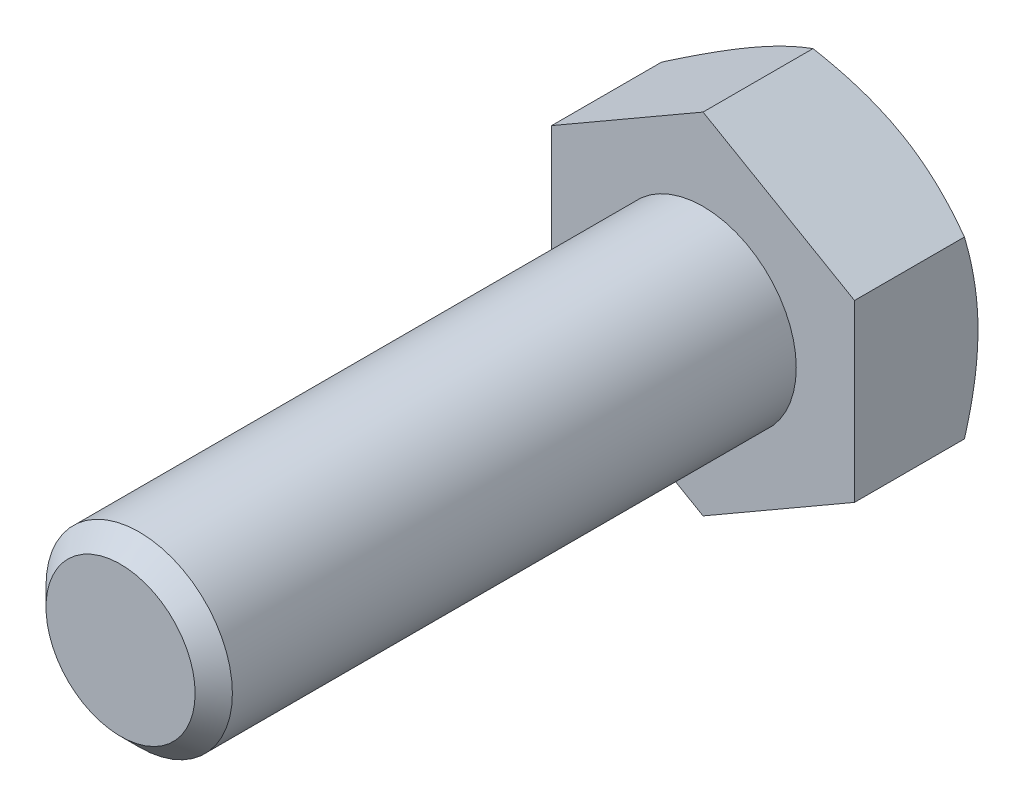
from build123d import *

# Parameters (mm, degrees)
ESQUISSE1_W        = 4
ESQUISSE1_H        = 25
CHANFREIN1_SIZE    = 0.8
BOSS_EXTRU_1_DEPTH = 5.3


with BuildPart() as part:
    # Esquisse1 → Base-R_volution (revolve)
    with BuildSketch(Plane(origin=(0, 0, 0), x_dir=(1, 0, 0), z_dir=(0, 1, 0))):
        with Locations((2, -12.5)):
            Rectangle(ESQUISSE1_W, ESQUISSE1_H)
    revolve(axis=Axis((0, 0, 0), (0, 0, 1)))

    # Chanfrein1
    chanfrein1_edges = [part.edges().sort_by_distance(p)[0] for p in [
        (-4, 0, 25),
    ]]
    chamfer(chanfrein1_edges, length=CHANFREIN1_SIZE)

    # Esquisse6 → Boss.-Extru.1 (add)
    with BuildSketch(Plane.XY):
        Polygon((6.5, -3.75277675), (6.5, 3.75277675), (0, 7.505553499), (-6.5, 3.75277675), (-6.5, -3.75277675), (0, -7.505553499), align=None)
    extrude(amount=-BOSS_EXTRU_1_DEPTH)

    # Esquisse7 → Enl_vement de mati_re-R_volution1 (revolve, cut)
    with BuildSketch(Plane(origin=(0, 0, 0), x_dir=(1, 0, 0), z_dir=(0, 1, 0))):
        Polygon((-6.5, 5.3), (-15.67986928, 5.3), (-15.67986928, 0), align=None)
    revolve(axis=Axis((0, 0, -6.239446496), (0, 0, 1)), mode=Mode.SUBTRACT)


solid = part.part
